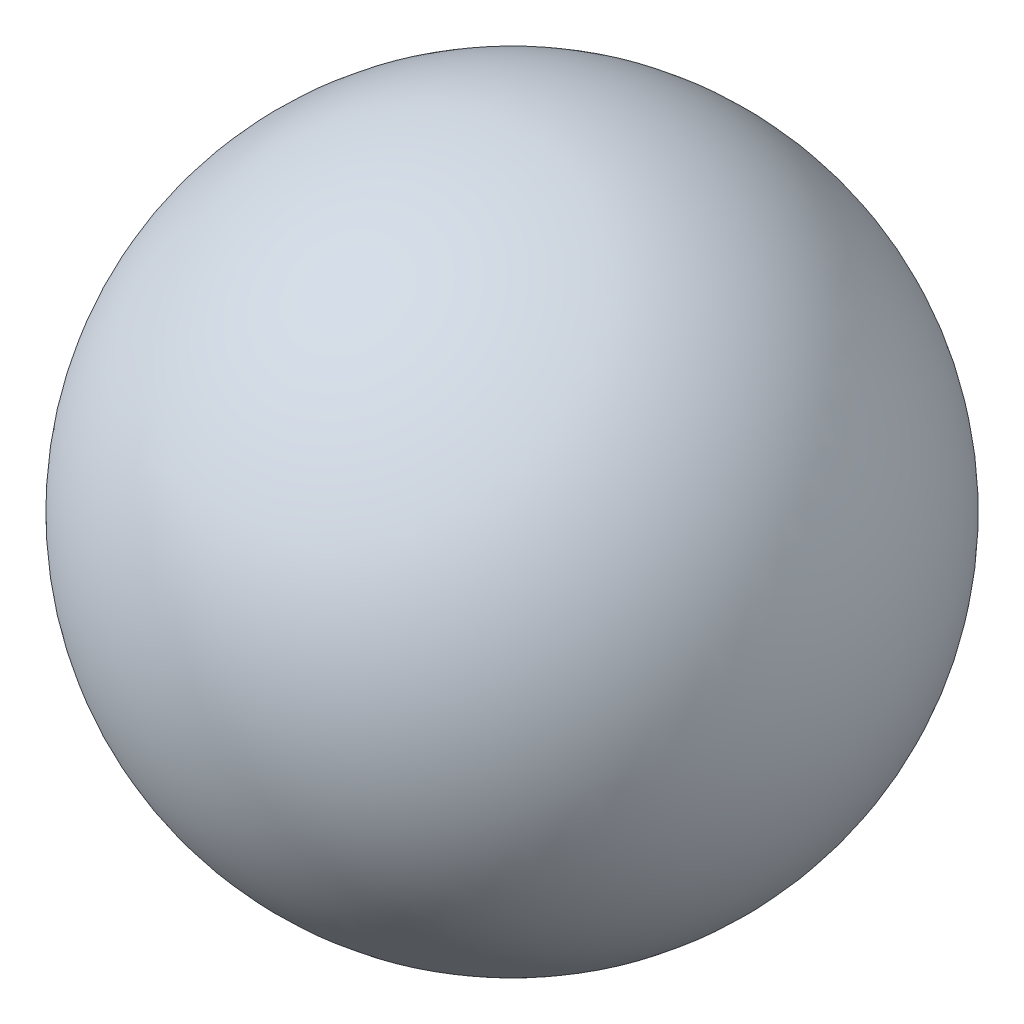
ISO-10303-21;
HEADER;
FILE_DESCRIPTION(('STEP AP214'),'2;1');
FILE_NAME('part.step','',(''),(''),'','','');
FILE_SCHEMA(('AUTOMOTIVE_DESIGN { 1 0 10303 214 1 1 1 1 }'));
ENDSEC;
DATA;
#1=APPLICATION_CONTEXT('core data for automotive mechanical design processes');
#2=APPLICATION_PROTOCOL_DEFINITION('international standard','automotive_design',2000,#1);
#3=PRODUCT_CONTEXT('',#1,'mechanical');
#4=PRODUCT('Part','Part','',(#3));
#5=PRODUCT_RELATED_PRODUCT_CATEGORY('part','',(#4));
#6=PRODUCT_DEFINITION_FORMATION('','',#4);
#7=PRODUCT_DEFINITION_CONTEXT('part definition',#1,'design');
#8=PRODUCT_DEFINITION('design','',#6,#7);
#9=PRODUCT_DEFINITION_SHAPE('','',#8);
#10=(LENGTH_UNIT() NAMED_UNIT(*) SI_UNIT(.MILLI.,.METRE.));
#11=(NAMED_UNIT(*) PLANE_ANGLE_UNIT() SI_UNIT($,.RADIAN.));
#12=(NAMED_UNIT(*) SI_UNIT($,.STERADIAN.) SOLID_ANGLE_UNIT());
#13=UNCERTAINTY_MEASURE_WITH_UNIT(LENGTH_MEASURE(1.E-05),#10,'distance_accuracy_value','');
#14=(GEOMETRIC_REPRESENTATION_CONTEXT(3) GLOBAL_UNCERTAINTY_ASSIGNED_CONTEXT((#13)) GLOBAL_UNIT_ASSIGNED_CONTEXT((#10,
#11,#12)) REPRESENTATION_CONTEXT('',''));
#15=CARTESIAN_POINT('',(0.,0.,0.));
#16=DIRECTION('',(0.,0.,1.));
#17=DIRECTION('',(1.,0.,0.));
#18=AXIS2_PLACEMENT_3D('',#15,#16,#17);
#19=CARTESIAN_POINT('',(8.49999999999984,21.7500000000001,0.));
#20=DIRECTION('',(0.,1.,0.));
#21=DIRECTION('',(1.,0.,0.));
#22=AXIS2_PLACEMENT_3D('',#19,#20,#21);
#23=SPHERICAL_SURFACE('',#22,5.55);
#24=CARTESIAN_POINT('',(8.49999999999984,27.3000000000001,0.));
#25=VERTEX_POINT('',#24);
#26=VERTEX_LOOP('',#25);
#27=FACE_BOUND('',#26,.T.);
#28=ADVANCED_FACE('F28',(#27),#23,.T.);
#29=CLOSED_SHELL('',(#28));
#30=MANIFOLD_SOLID_BREP('B2',#29);
#31=ADVANCED_BREP_SHAPE_REPRESENTATION('',(#18,#30),#14);
#32=SHAPE_DEFINITION_REPRESENTATION(#9,#31);
ENDSEC;
END-ISO-10303-21;
